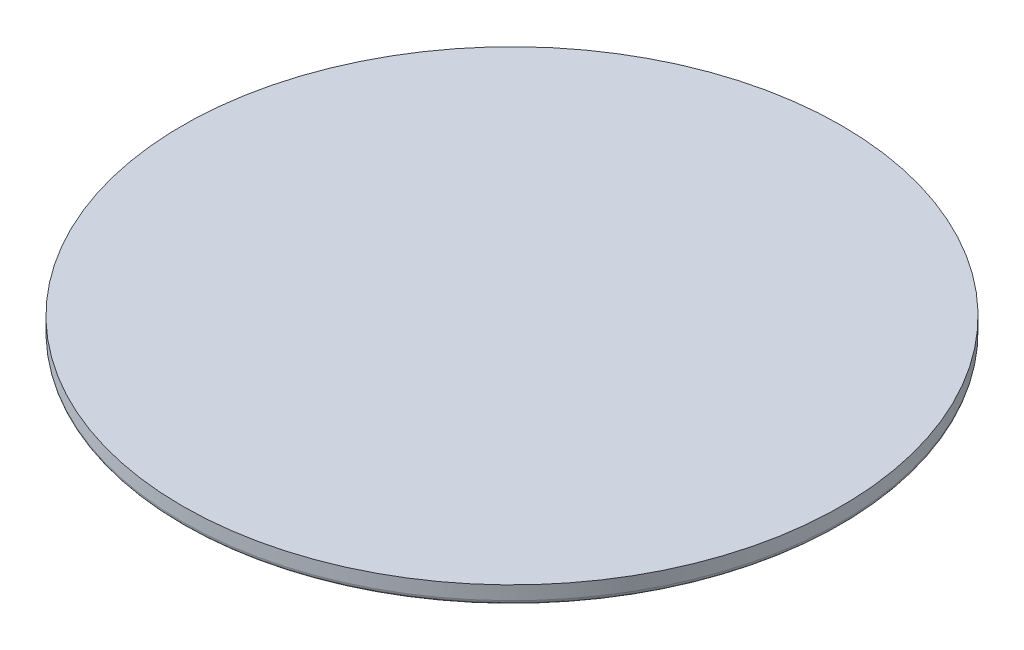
ISO-10303-21;
HEADER;
FILE_DESCRIPTION(('STEP AP214'),'2;1');
FILE_NAME('part.step','',(''),(''),'','','');
FILE_SCHEMA(('AUTOMOTIVE_DESIGN { 1 0 10303 214 1 1 1 1 }'));
ENDSEC;
DATA;
#1=APPLICATION_CONTEXT('core data for automotive mechanical design processes');
#2=APPLICATION_PROTOCOL_DEFINITION('international standard','automotive_design',2000,#1);
#3=PRODUCT_CONTEXT('',#1,'mechanical');
#4=PRODUCT('Part','Part','',(#3));
#5=PRODUCT_RELATED_PRODUCT_CATEGORY('part','',(#4));
#6=PRODUCT_DEFINITION_FORMATION('','',#4);
#7=PRODUCT_DEFINITION_CONTEXT('part definition',#1,'design');
#8=PRODUCT_DEFINITION('design','',#6,#7);
#9=PRODUCT_DEFINITION_SHAPE('','',#8);
#10=(LENGTH_UNIT() NAMED_UNIT(*) SI_UNIT(.MILLI.,.METRE.));
#11=(NAMED_UNIT(*) PLANE_ANGLE_UNIT() SI_UNIT($,.RADIAN.));
#12=(NAMED_UNIT(*) SI_UNIT($,.STERADIAN.) SOLID_ANGLE_UNIT());
#13=UNCERTAINTY_MEASURE_WITH_UNIT(LENGTH_MEASURE(1.E-05),#10,'distance_accuracy_value','');
#14=(GEOMETRIC_REPRESENTATION_CONTEXT(3) GLOBAL_UNCERTAINTY_ASSIGNED_CONTEXT((#13)) GLOBAL_UNIT_ASSIGNED_CONTEXT((#10,
#11,#12)) REPRESENTATION_CONTEXT('',''));
#15=CARTESIAN_POINT('',(0.,0.,0.));
#16=DIRECTION('',(0.,0.,1.));
#17=DIRECTION('',(1.,0.,0.));
#18=AXIS2_PLACEMENT_3D('',#15,#16,#17);
#19=CARTESIAN_POINT('',(-19.56621964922,-22.3506053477,0.));
#20=DIRECTION('',(0.,-1.,0.));
#21=DIRECTION('',(0.,0.,-1.));
#22=AXIS2_PLACEMENT_3D('',#19,#20,#21);
#23=PLANE('',#22);
#24=CARTESIAN_POINT('',(-19.56621964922,-22.3506053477,0.));
#25=DIRECTION('',(0.,1.,0.));
#26=DIRECTION('',(0.,0.,-1.));
#27=AXIS2_PLACEMENT_3D('',#24,#25,#26);
#28=CIRCLE('',#27,16.2);
#29=CARTESIAN_POINT('',(-19.56621964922,-22.3506053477,-16.2));
#30=VERTEX_POINT('',#29);
#31=EDGE_CURVE('E24',#30,#30,#28,.T.);
#32=ORIENTED_EDGE('',*,*,#31,.F.);
#33=EDGE_LOOP('',(#32));
#34=FACE_BOUND('',#33,.T.);
#35=ADVANCED_FACE('F13',(#34),#23,.T.);
#36=CARTESIAN_POINT('',(-19.56621964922,-22.1306053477,0.));
#37=DIRECTION('',(0.,-1.,0.));
#38=DIRECTION('',(0.,0.,-1.));
#39=AXIS2_PLACEMENT_3D('',#36,#37,#38);
#40=TOROIDAL_SURFACE('',#39,16.2,0.22);
#41=CARTESIAN_POINT('',(-19.56621964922,-22.1306053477,0.));
#42=DIRECTION('',(0.,-1.,0.));
#43=DIRECTION('',(0.,0.,-1.));
#44=AXIS2_PLACEMENT_3D('',#41,#42,#43);
#45=CIRCLE('',#44,16.42);
#46=CARTESIAN_POINT('',(-19.56621964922,-22.1306053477,-16.42));
#47=VERTEX_POINT('',#46);
#48=EDGE_CURVE('E20',#47,#47,#45,.F.);
#49=ORIENTED_EDGE('',*,*,#48,.F.);
#50=EDGE_LOOP('',(#49));
#51=FACE_BOUND('',#50,.T.);
#52=ORIENTED_EDGE('',*,*,#31,.T.);
#53=EDGE_LOOP('',(#52));
#54=FACE_BOUND('',#53,.T.);
#55=ADVANCED_FACE('F34',(#51,#54),#40,.T.);
#56=CARTESIAN_POINT('',(-19.56621964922,-21.4506053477,0.));
#57=DIRECTION('',(0.,-1.,0.));
#58=DIRECTION('',(0.,0.,-1.));
#59=AXIS2_PLACEMENT_3D('',#56,#57,#58);
#60=CYLINDRICAL_SURFACE('',#59,16.42);
#61=ORIENTED_EDGE('',*,*,#48,.T.);
#62=EDGE_LOOP('',(#61));
#63=FACE_BOUND('',#62,.T.);
#64=CARTESIAN_POINT('',(-19.56621964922,-21.4506053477,0.));
#65=DIRECTION('',(0.,-1.,0.));
#66=DIRECTION('',(0.,0.,-1.));
#67=AXIS2_PLACEMENT_3D('',#64,#65,#66);
#68=CIRCLE('',#67,16.42);
#69=CARTESIAN_POINT('',(-19.56621964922,-21.4506053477,-16.42));
#70=VERTEX_POINT('',#69);
#71=EDGE_CURVE('E8',#70,#70,#68,.T.);
#72=ORIENTED_EDGE('',*,*,#71,.T.);
#73=EDGE_LOOP('',(#72));
#74=FACE_BOUND('',#73,.T.);
#75=ADVANCED_FACE('F38',(#63,#74),#60,.T.);
#76=CARTESIAN_POINT('',(-19.56621964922,-21.4506053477,0.));
#77=DIRECTION('',(0.,-1.,0.));
#78=DIRECTION('',(0.,0.,-1.));
#79=AXIS2_PLACEMENT_3D('',#76,#77,#78);
#80=PLANE('',#79);
#81=ORIENTED_EDGE('',*,*,#71,.F.);
#82=EDGE_LOOP('',(#81));
#83=FACE_BOUND('',#82,.T.);
#84=ADVANCED_FACE('F62',(#83),#80,.F.);
#85=CLOSED_SHELL('',(#35,#55,#75,#84));
#86=MANIFOLD_SOLID_BREP('B1',#85);
#87=ADVANCED_BREP_SHAPE_REPRESENTATION('',(#18,#86),#14);
#88=SHAPE_DEFINITION_REPRESENTATION(#9,#87);
ENDSEC;
END-ISO-10303-21;
